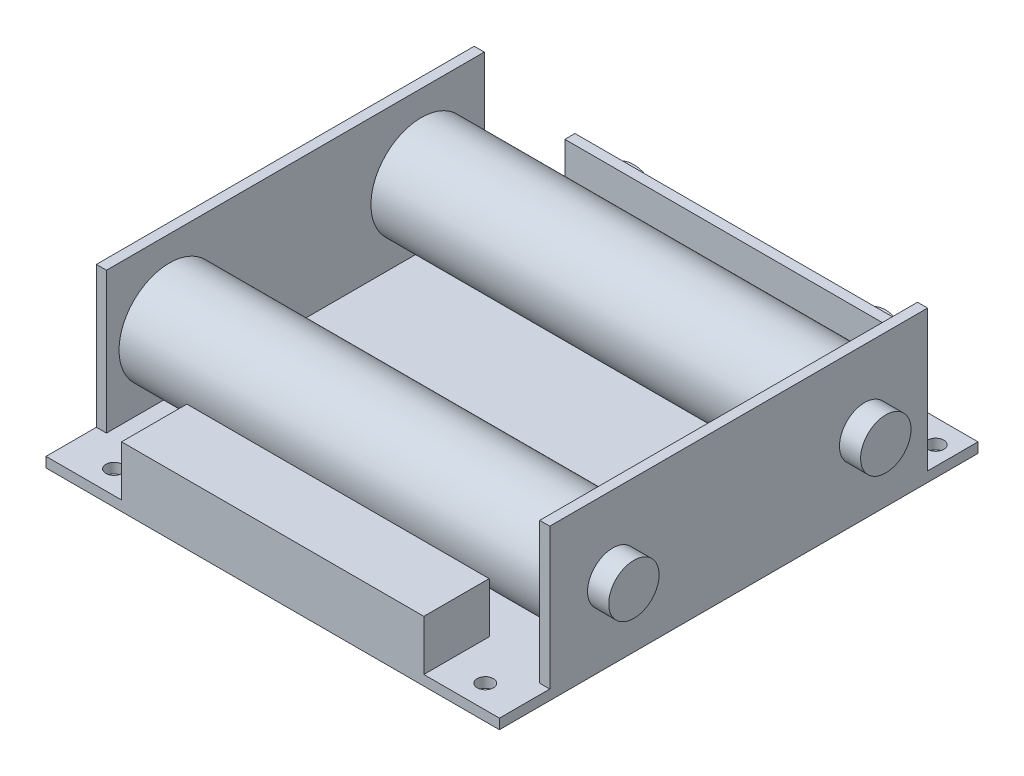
ISO-10303-21;
HEADER;
FILE_DESCRIPTION(('STEP AP214'),'2;1');
FILE_NAME('part.step','',(''),(''),'','','');
FILE_SCHEMA(('AUTOMOTIVE_DESIGN { 1 0 10303 214 1 1 1 1 }'));
ENDSEC;
DATA;
#1=APPLICATION_CONTEXT('core data for automotive mechanical design processes');
#2=APPLICATION_PROTOCOL_DEFINITION('international standard','automotive_design',2000,#1);
#3=PRODUCT_CONTEXT('',#1,'mechanical');
#4=PRODUCT('Part','Part','',(#3));
#5=PRODUCT_RELATED_PRODUCT_CATEGORY('part','',(#4));
#6=PRODUCT_DEFINITION_FORMATION('','',#4);
#7=PRODUCT_DEFINITION_CONTEXT('part definition',#1,'design');
#8=PRODUCT_DEFINITION('design','',#6,#7);
#9=PRODUCT_DEFINITION_SHAPE('','',#8);
#10=(LENGTH_UNIT() NAMED_UNIT(*) SI_UNIT(.MILLI.,.METRE.));
#11=(NAMED_UNIT(*) PLANE_ANGLE_UNIT() SI_UNIT($,.RADIAN.));
#12=(NAMED_UNIT(*) SI_UNIT($,.STERADIAN.) SOLID_ANGLE_UNIT());
#13=UNCERTAINTY_MEASURE_WITH_UNIT(LENGTH_MEASURE(1.E-05),#10,'distance_accuracy_value','');
#14=(GEOMETRIC_REPRESENTATION_CONTEXT(3) GLOBAL_UNCERTAINTY_ASSIGNED_CONTEXT((#13)) GLOBAL_UNIT_ASSIGNED_CONTEXT((#10,
#11,#12)) REPRESENTATION_CONTEXT('',''));
#15=CARTESIAN_POINT('',(0.,0.,0.));
#16=DIRECTION('',(0.,0.,1.));
#17=DIRECTION('',(1.,0.,0.));
#18=AXIS2_PLACEMENT_3D('',#15,#16,#17);
#19=CARTESIAN_POINT('',(-49.2,15.,25.));
#20=DIRECTION('',(1.,0.,0.));
#21=DIRECTION('',(0.,0.,-1.));
#22=AXIS2_PLACEMENT_3D('',#19,#20,#21);
#23=CYLINDRICAL_SURFACE('',#22,10.);
#24=CARTESIAN_POINT('',(43.,15.,25.));
#25=DIRECTION('',(1.,0.,0.));
#26=DIRECTION('',(0.,0.,-1.));
#27=AXIS2_PLACEMENT_3D('',#24,#25,#26);
#28=CIRCLE('',#27,10.);
#29=CARTESIAN_POINT('',(43.,15.,15.));
#30=VERTEX_POINT('',#29);
#31=EDGE_CURVE('E11',#30,#30,#28,.F.);
#32=ORIENTED_EDGE('',*,*,#31,.T.);
#33=EDGE_LOOP('',(#32));
#34=FACE_BOUND('',#33,.T.);
#35=CARTESIAN_POINT('',(-43.,15.,25.));
#36=DIRECTION('',(1.,0.,0.));
#37=DIRECTION('',(0.,0.,-1.));
#38=AXIS2_PLACEMENT_3D('',#35,#36,#37);
#39=CIRCLE('',#38,10.);
#40=CARTESIAN_POINT('',(-43.,15.,15.));
#41=VERTEX_POINT('',#40);
#42=EDGE_CURVE('E45',#41,#41,#39,.T.);
#43=ORIENTED_EDGE('',*,*,#42,.T.);
#44=EDGE_LOOP('',(#43));
#45=FACE_BOUND('',#44,.T.);
#46=ADVANCED_FACE('F44',(#34,#45),#23,.T.);
#47=OPEN_SHELL('',(#46));
#48=SHELL_BASED_SURFACE_MODEL('B2',(#47));
#49=CARTESIAN_POINT('',(-49.2,15.,-25.));
#50=DIRECTION('',(1.,0.,0.));
#51=DIRECTION('',(0.,0.,-1.));
#52=AXIS2_PLACEMENT_3D('',#49,#50,#51);
#53=CYLINDRICAL_SURFACE('',#52,10.);
#54=CARTESIAN_POINT('',(43.,15.,-25.));
#55=DIRECTION('',(1.,0.,0.));
#56=DIRECTION('',(0.,0.,-1.));
#57=AXIS2_PLACEMENT_3D('',#54,#55,#56);
#58=CIRCLE('',#57,10.);
#59=CARTESIAN_POINT('',(43.,15.,-35.));
#60=VERTEX_POINT('',#59);
#61=EDGE_CURVE('E84',#60,#60,#58,.F.);
#62=ORIENTED_EDGE('',*,*,#61,.T.);
#63=EDGE_LOOP('',(#62));
#64=FACE_BOUND('',#63,.T.);
#65=CARTESIAN_POINT('',(-43.,15.,-25.));
#66=DIRECTION('',(1.,0.,0.));
#67=DIRECTION('',(0.,0.,-1.));
#68=AXIS2_PLACEMENT_3D('',#65,#66,#67);
#69=CIRCLE('',#68,10.);
#70=CARTESIAN_POINT('',(-43.,15.,-35.));
#71=VERTEX_POINT('',#70);
#72=EDGE_CURVE('E43',#71,#71,#69,.T.);
#73=ORIENTED_EDGE('',*,*,#72,.T.);
#74=EDGE_LOOP('',(#73));
#75=FACE_BOUND('',#74,.T.);
#76=ADVANCED_FACE('F80',(#64,#75),#53,.T.);
#77=OPEN_SHELL('',(#76));
#78=SHELL_BASED_SURFACE_MODEL('B6',(#77));
#79=CARTESIAN_POINT('',(45.,2.,-47.5));
#80=DIRECTION('',(0.,0.,1.));
#81=DIRECTION('',(1.,0.,0.));
#82=AXIS2_PLACEMENT_3D('',#79,#80,#81);
#83=PLANE('',#82);
#84=CARTESIAN_POINT('',(22.45,6.3,-47.5));
#85=DIRECTION('',(0.,0.,1.));
#86=DIRECTION('',(1.,0.,0.));
#87=AXIS2_PLACEMENT_3D('',#84,#85,#86);
#88=CIRCLE('',#87,5.);
#89=CARTESIAN_POINT('',(27.45,6.3,-47.5));
#90=VERTEX_POINT('',#89);
#91=EDGE_CURVE('E115',#90,#90,#88,.F.);
#92=ORIENTED_EDGE('',*,*,#91,.F.);
#93=EDGE_LOOP('',(#92));
#94=FACE_BOUND('',#93,.T.);
#95=DIRECTION('',(-1.,0.,0.));
#96=VECTOR('',#95,1.);
#97=CARTESIAN_POINT('',(45.,2.,-47.5));
#98=LINE('',#97,#96);
#99=CARTESIAN_POINT('',(-35.,2.,-47.5));
#100=VERTEX_POINT('',#99);
#101=CARTESIAN_POINT('',(-45.,2.,-47.5));
#102=VERTEX_POINT('',#101);
#103=EDGE_CURVE('E431',#100,#102,#98,.T.);
#104=ORIENTED_EDGE('',*,*,#103,.F.);
#105=DIRECTION('',(0.,1.,0.));
#106=VECTOR('',#105,1.);
#107=CARTESIAN_POINT('',(-35.,0.,-47.5));
#108=LINE('',#107,#106);
#109=CARTESIAN_POINT('',(-35.,15.,-47.5));
#110=VERTEX_POINT('',#109);
#111=EDGE_CURVE('E271',#100,#110,#108,.T.);
#112=ORIENTED_EDGE('',*,*,#111,.T.);
#113=DIRECTION('',(1.,0.,0.));
#114=VECTOR('',#113,1.);
#115=CARTESIAN_POINT('',(35.,15.,-47.5));
#116=LINE('',#115,#114);
#117=CARTESIAN_POINT('',(35.,15.,-47.5));
#118=VERTEX_POINT('',#117);
#119=EDGE_CURVE('E259',#110,#118,#116,.T.);
#120=ORIENTED_EDGE('',*,*,#119,.T.);
#121=DIRECTION('',(0.,-1.,0.));
#122=VECTOR('',#121,1.);
#123=CARTESIAN_POINT('',(35.,0.,-47.5));
#124=LINE('',#123,#122);
#125=CARTESIAN_POINT('',(35.,2.,-47.5));
#126=VERTEX_POINT('',#125);
#127=EDGE_CURVE('E268',#118,#126,#124,.T.);
#128=ORIENTED_EDGE('',*,*,#127,.T.);
#129=CARTESIAN_POINT('',(45.,2.,-47.5));
#130=VERTEX_POINT('',#129);
#131=EDGE_CURVE('E432',#130,#126,#98,.T.);
#132=ORIENTED_EDGE('',*,*,#131,.F.);
#133=DIRECTION('',(0.,-1.,0.));
#134=VECTOR('',#133,1.);
#135=CARTESIAN_POINT('',(45.,2.,-47.5));
#136=LINE('',#135,#134);
#137=CARTESIAN_POINT('',(45.,0.,-47.5));
#138=VERTEX_POINT('',#137);
#139=EDGE_CURVE('E444',#130,#138,#136,.T.);
#140=ORIENTED_EDGE('',*,*,#139,.T.);
#141=DIRECTION('',(-1.,0.,0.));
#142=VECTOR('',#141,1.);
#143=CARTESIAN_POINT('',(45.,0.,-47.5));
#144=LINE('',#143,#142);
#145=CARTESIAN_POINT('',(-45.,0.,-47.5));
#146=VERTEX_POINT('',#145);
#147=EDGE_CURVE('E440',#138,#146,#144,.T.);
#148=ORIENTED_EDGE('',*,*,#147,.T.);
#149=DIRECTION('',(0.,-1.,0.));
#150=VECTOR('',#149,1.);
#151=CARTESIAN_POINT('',(-45.,2.,-47.5));
#152=LINE('',#151,#150);
#153=EDGE_CURVE('E434',#102,#146,#152,.T.);
#154=ORIENTED_EDGE('',*,*,#153,.F.);
#155=EDGE_LOOP('',(#104,#112,#120,#128,#132,#140,#148,#154));
#156=FACE_BOUND('',#155,.T.);
#157=CARTESIAN_POINT('',(-27.55,6.3,-47.5));
#158=DIRECTION('',(0.,0.,1.));
#159=DIRECTION('',(1.,0.,0.));
#160=AXIS2_PLACEMENT_3D('',#157,#158,#159);
#161=CIRCLE('',#160,5.);
#162=CARTESIAN_POINT('',(-22.55,6.3,-47.5));
#163=VERTEX_POINT('',#162);
#164=EDGE_CURVE('E78',#163,#163,#161,.F.);
#165=ORIENTED_EDGE('',*,*,#164,.F.);
#166=EDGE_LOOP('',(#165));
#167=FACE_BOUND('',#166,.T.);
#168=ADVANCED_FACE('F107',(#94,#156,#167),#83,.F.);
#169=CARTESIAN_POINT('',(0.,2.,0.));
#170=DIRECTION('',(0.,-1.,0.));
#171=DIRECTION('',(0.,0.,-1.));
#172=AXIS2_PLACEMENT_3D('',#169,#170,#171);
#173=PLANE('',#172);
#174=ORIENTED_EDGE('',*,*,#131,.T.);
#175=DIRECTION('',(0.,0.,1.));
#176=VECTOR('',#175,1.);
#177=CARTESIAN_POINT('',(35.,2.,0.));
#178=LINE('',#177,#176);
#179=CARTESIAN_POINT('',(35.,2.,-45.5));
#180=VERTEX_POINT('',#179);
#181=EDGE_CURVE('E127',#126,#180,#178,.T.);
#182=ORIENTED_EDGE('',*,*,#181,.T.);
#183=DIRECTION('',(-1.,0.,0.));
#184=VECTOR('',#183,1.);
#185=CARTESIAN_POINT('',(0.,2.,-45.5));
#186=LINE('',#185,#184);
#187=CARTESIAN_POINT('',(-35.,2.,-45.5));
#188=VERTEX_POINT('',#187);
#189=EDGE_CURVE('E122',#180,#188,#186,.T.);
#190=ORIENTED_EDGE('',*,*,#189,.T.);
#191=DIRECTION('',(0.,0.,-1.));
#192=VECTOR('',#191,1.);
#193=CARTESIAN_POINT('',(-35.,2.,0.));
#194=LINE('',#193,#192);
#195=EDGE_CURVE('E249',#188,#100,#194,.T.);
#196=ORIENTED_EDGE('',*,*,#195,.T.);
#197=ORIENTED_EDGE('',*,*,#103,.T.);
#198=DIRECTION('',(0.,0.,1.));
#199=VECTOR('',#198,1.);
#200=CARTESIAN_POINT('',(-45.,2.,-47.5));
#201=LINE('',#200,#199);
#202=CARTESIAN_POINT('',(-45.,2.,-37.5));
#203=VERTEX_POINT('',#202);
#204=EDGE_CURVE('E422',#102,#203,#201,.T.);
#205=ORIENTED_EDGE('',*,*,#204,.T.);
#206=DIRECTION('',(-1.,0.,0.));
#207=VECTOR('',#206,1.);
#208=CARTESIAN_POINT('',(0.,2.,-37.5));
#209=LINE('',#208,#207);
#210=CARTESIAN_POINT('',(-43.,2.,-37.5));
#211=VERTEX_POINT('',#210);
#212=EDGE_CURVE('E363',#211,#203,#209,.T.);
#213=ORIENTED_EDGE('',*,*,#212,.F.);
#214=DIRECTION('',(0.,0.,1.));
#215=VECTOR('',#214,1.);
#216=CARTESIAN_POINT('',(-43.,2.,0.));
#217=LINE('',#216,#215);
#218=CARTESIAN_POINT('',(-43.,2.,37.5));
#219=VERTEX_POINT('',#218);
#220=EDGE_CURVE('E359',#211,#219,#217,.T.);
#221=ORIENTED_EDGE('',*,*,#220,.T.);
#222=DIRECTION('',(1.,0.,0.));
#223=VECTOR('',#222,1.);
#224=CARTESIAN_POINT('',(0.,2.,37.5));
#225=LINE('',#224,#223);
#226=CARTESIAN_POINT('',(-45.,2.,37.5));
#227=VERTEX_POINT('',#226);
#228=EDGE_CURVE('E366',#227,#219,#225,.T.);
#229=ORIENTED_EDGE('',*,*,#228,.F.);
#230=CARTESIAN_POINT('',(-45.,2.,47.5));
#231=VERTEX_POINT('',#230);
#232=EDGE_CURVE('E425',#227,#231,#201,.T.);
#233=ORIENTED_EDGE('',*,*,#232,.T.);
#234=DIRECTION('',(1.,0.,0.));
#235=VECTOR('',#234,1.);
#236=CARTESIAN_POINT('',(45.,2.,47.5));
#237=LINE('',#236,#235);
#238=CARTESIAN_POINT('',(-30.,2.,47.5));
#239=VERTEX_POINT('',#238);
#240=EDGE_CURVE('E426',#231,#239,#237,.T.);
#241=ORIENTED_EDGE('',*,*,#240,.T.);
#242=DIRECTION('',(0.,0.,1.));
#243=VECTOR('',#242,1.);
#244=CARTESIAN_POINT('',(-30.,2.,34.5));
#245=LINE('',#244,#243);
#246=CARTESIAN_POINT('',(-30.,2.,34.5));
#247=VERTEX_POINT('',#246);
#248=EDGE_CURVE('E279',#247,#239,#245,.T.);
#249=ORIENTED_EDGE('',*,*,#248,.F.);
#250=DIRECTION('',(-1.,0.,0.));
#251=VECTOR('',#250,1.);
#252=CARTESIAN_POINT('',(-30.,2.,34.5));
#253=LINE('',#252,#251);
#254=CARTESIAN_POINT('',(30.,2.,34.5));
#255=VERTEX_POINT('',#254);
#256=EDGE_CURVE('E284',#255,#247,#253,.T.);
#257=ORIENTED_EDGE('',*,*,#256,.F.);
#258=DIRECTION('',(0.,0.,-1.));
#259=VECTOR('',#258,1.);
#260=CARTESIAN_POINT('',(30.,2.,34.5));
#261=LINE('',#260,#259);
#262=CARTESIAN_POINT('',(30.,2.,47.5));
#263=VERTEX_POINT('',#262);
#264=EDGE_CURVE('E293',#263,#255,#261,.T.);
#265=ORIENTED_EDGE('',*,*,#264,.F.);
#266=CARTESIAN_POINT('',(45.,2.,47.5));
#267=VERTEX_POINT('',#266);
#268=EDGE_CURVE('E424',#263,#267,#237,.T.);
#269=ORIENTED_EDGE('',*,*,#268,.T.);
#270=DIRECTION('',(0.,0.,-1.));
#271=VECTOR('',#270,1.);
#272=CARTESIAN_POINT('',(45.,2.,-47.5));
#273=LINE('',#272,#271);
#274=CARTESIAN_POINT('',(45.,2.,37.5));
#275=VERTEX_POINT('',#274);
#276=EDGE_CURVE('E429',#267,#275,#273,.T.);
#277=ORIENTED_EDGE('',*,*,#276,.T.);
#278=DIRECTION('',(-1.,0.,0.));
#279=VECTOR('',#278,1.);
#280=CARTESIAN_POINT('',(0.,2.,37.5));
#281=LINE('',#280,#279);
#282=CARTESIAN_POINT('',(43.,2.,37.5));
#283=VERTEX_POINT('',#282);
#284=EDGE_CURVE('E395',#275,#283,#281,.T.);
#285=ORIENTED_EDGE('',*,*,#284,.T.);
#286=DIRECTION('',(0.,0.,-1.));
#287=VECTOR('',#286,1.);
#288=CARTESIAN_POINT('',(43.,2.,0.));
#289=LINE('',#288,#287);
#290=CARTESIAN_POINT('',(43.,2.,-37.5));
#291=VERTEX_POINT('',#290);
#292=EDGE_CURVE('E388',#283,#291,#289,.T.);
#293=ORIENTED_EDGE('',*,*,#292,.T.);
#294=DIRECTION('',(1.,0.,0.));
#295=VECTOR('',#294,1.);
#296=CARTESIAN_POINT('',(0.,2.,-37.5));
#297=LINE('',#296,#295);
#298=CARTESIAN_POINT('',(45.,2.,-37.5));
#299=VERTEX_POINT('',#298);
#300=EDGE_CURVE('E392',#291,#299,#297,.T.);
#301=ORIENTED_EDGE('',*,*,#300,.T.);
#302=EDGE_CURVE('E428',#299,#130,#273,.T.);
#303=ORIENTED_EDGE('',*,*,#302,.T.);
#304=EDGE_LOOP('',(#174,#182,#190,#196,#197,#205,#213,#221,#229,#233,#241,#249,#257,#265,#269,
#277,#285,#293,#301,#303));
#305=FACE_BOUND('',#304,.T.);
#306=CARTESIAN_POINT('',(-36.1,2.,42.9));
#307=DIRECTION('',(0.,-1.,0.));
#308=DIRECTION('',(0.,0.,-1.));
#309=AXIS2_PLACEMENT_3D('',#306,#307,#308);
#310=CIRCLE('',#309,1.6);
#311=CARTESIAN_POINT('',(-36.1,2.,41.3));
#312=VERTEX_POINT('',#311);
#313=EDGE_CURVE('E400',#312,#312,#310,.T.);
#314=ORIENTED_EDGE('',*,*,#313,.T.);
#315=EDGE_LOOP('',(#314));
#316=FACE_BOUND('',#315,.T.);
#317=CARTESIAN_POINT('',(37.6,2.,42.9));
#318=DIRECTION('',(0.,-1.,0.));
#319=DIRECTION('',(0.,0.,-1.));
#320=AXIS2_PLACEMENT_3D('',#317,#318,#319);
#321=CIRCLE('',#320,1.6);
#322=CARTESIAN_POINT('',(37.6,2.,41.3));
#323=VERTEX_POINT('',#322);
#324=EDGE_CURVE('E406',#323,#323,#321,.T.);
#325=ORIENTED_EDGE('',*,*,#324,.T.);
#326=EDGE_LOOP('',(#325));
#327=FACE_BOUND('',#326,.T.);
#328=CARTESIAN_POINT('',(41.3,2.,-42.8));
#329=DIRECTION('',(0.,-1.,0.));
#330=DIRECTION('',(0.,0.,-1.));
#331=AXIS2_PLACEMENT_3D('',#328,#329,#330);
#332=CIRCLE('',#331,1.6);
#333=CARTESIAN_POINT('',(41.3,2.,-44.4));
#334=VERTEX_POINT('',#333);
#335=EDGE_CURVE('E412',#334,#334,#332,.T.);
#336=ORIENTED_EDGE('',*,*,#335,.T.);
#337=EDGE_LOOP('',(#336));
#338=FACE_BOUND('',#337,.T.);
#339=CARTESIAN_POINT('',(-38.7,2.,-42.8));
#340=DIRECTION('',(0.,-1.,0.));
#341=DIRECTION('',(0.,0.,-1.));
#342=AXIS2_PLACEMENT_3D('',#339,#340,#341);
#343=CIRCLE('',#342,1.6);
#344=CARTESIAN_POINT('',(-38.7,2.,-44.4));
#345=VERTEX_POINT('',#344);
#346=EDGE_CURVE('E418',#345,#345,#343,.T.);
#347=ORIENTED_EDGE('',*,*,#346,.T.);
#348=EDGE_LOOP('',(#347));
#349=FACE_BOUND('',#348,.T.);
#350=ADVANCED_FACE('F463',(#305,#316,#327,#338,#349),#173,.F.);
#351=CARTESIAN_POINT('',(-45.,2.,-47.5));
#352=DIRECTION('',(1.,0.,0.));
#353=DIRECTION('',(0.,0.,-1.));
#354=AXIS2_PLACEMENT_3D('',#351,#352,#353);
#355=PLANE('',#354);
#356=CARTESIAN_POINT('',(-45.,15.,-25.));
#357=DIRECTION('',(1.,0.,0.));
#358=DIRECTION('',(0.,0.,-1.));
#359=AXIS2_PLACEMENT_3D('',#356,#357,#358);
#360=CIRCLE('',#359,5.);
#361=CARTESIAN_POINT('',(-45.,15.,-30.));
#362=VERTEX_POINT('',#361);
#363=EDGE_CURVE('E322',#362,#362,#360,.T.);
#364=ORIENTED_EDGE('',*,*,#363,.T.);
#365=EDGE_LOOP('',(#364));
#366=FACE_BOUND('',#365,.T.);
#367=CARTESIAN_POINT('',(-45.,15.,25.));
#368=DIRECTION('',(1.,0.,0.));
#369=DIRECTION('',(0.,0.,-1.));
#370=AXIS2_PLACEMENT_3D('',#367,#368,#369);
#371=CIRCLE('',#370,5.);
#372=CARTESIAN_POINT('',(-45.,15.,20.));
#373=VERTEX_POINT('',#372);
#374=EDGE_CURVE('E338',#373,#373,#371,.T.);
#375=ORIENTED_EDGE('',*,*,#374,.T.);
#376=EDGE_LOOP('',(#375));
#377=FACE_BOUND('',#376,.T.);
#378=DIRECTION('',(0.,0.,1.));
#379=VECTOR('',#378,1.);
#380=CARTESIAN_POINT('',(-45.,0.,-47.5));
#381=LINE('',#380,#379);
#382=CARTESIAN_POINT('',(-45.,0.,47.5));
#383=VERTEX_POINT('',#382);
#384=EDGE_CURVE('E421',#146,#383,#381,.T.);
#385=ORIENTED_EDGE('',*,*,#384,.T.);
#386=DIRECTION('',(0.,-1.,0.));
#387=VECTOR('',#386,1.);
#388=CARTESIAN_POINT('',(-45.,2.,47.5));
#389=LINE('',#388,#387);
#390=EDGE_CURVE('E450',#231,#383,#389,.T.);
#391=ORIENTED_EDGE('',*,*,#390,.F.);
#392=ORIENTED_EDGE('',*,*,#232,.F.);
#393=DIRECTION('',(0.,-1.,0.));
#394=VECTOR('',#393,1.);
#395=CARTESIAN_POINT('',(-45.,0.,37.5));
#396=LINE('',#395,#394);
#397=CARTESIAN_POINT('',(-45.,30.,37.5));
#398=VERTEX_POINT('',#397);
#399=EDGE_CURVE('E341',#398,#227,#396,.T.);
#400=ORIENTED_EDGE('',*,*,#399,.F.);
#401=DIRECTION('',(0.,0.,1.));
#402=VECTOR('',#401,1.);
#403=CARTESIAN_POINT('',(-45.,30.,37.5));
#404=LINE('',#403,#402);
#405=CARTESIAN_POINT('',(-45.,30.,-37.5));
#406=VERTEX_POINT('',#405);
#407=EDGE_CURVE('E353',#406,#398,#404,.T.);
#408=ORIENTED_EDGE('',*,*,#407,.F.);
#409=DIRECTION('',(0.,1.,0.));
#410=VECTOR('',#409,1.);
#411=CARTESIAN_POINT('',(-45.,0.,-37.5));
#412=LINE('',#411,#410);
#413=EDGE_CURVE('E346',#203,#406,#412,.T.);
#414=ORIENTED_EDGE('',*,*,#413,.F.);
#415=ORIENTED_EDGE('',*,*,#204,.F.);
#416=ORIENTED_EDGE('',*,*,#153,.T.);
#417=EDGE_LOOP('',(#385,#391,#392,#400,#408,#414,#415,#416));
#418=FACE_BOUND('',#417,.T.);
#419=ADVANCED_FACE('F109',(#366,#377,#418),#355,.F.);
#420=CARTESIAN_POINT('',(45.,2.,47.5));
#421=DIRECTION('',(0.,0.,-1.));
#422=DIRECTION('',(-1.,0.,0.));
#423=AXIS2_PLACEMENT_3D('',#420,#421,#422);
#424=PLANE('',#423);
#425=DIRECTION('',(1.,0.,0.));
#426=VECTOR('',#425,1.);
#427=CARTESIAN_POINT('',(45.,0.,47.5));
#428=LINE('',#427,#426);
#429=CARTESIAN_POINT('',(45.,0.,47.5));
#430=VERTEX_POINT('',#429);
#431=EDGE_CURVE('E436',#383,#430,#428,.T.);
#432=ORIENTED_EDGE('',*,*,#431,.T.);
#433=DIRECTION('',(0.,-1.,0.));
#434=VECTOR('',#433,1.);
#435=CARTESIAN_POINT('',(45.,2.,47.5));
#436=LINE('',#435,#434);
#437=EDGE_CURVE('E447',#267,#430,#436,.T.);
#438=ORIENTED_EDGE('',*,*,#437,.F.);
#439=ORIENTED_EDGE('',*,*,#268,.F.);
#440=DIRECTION('',(0.,-1.,0.));
#441=VECTOR('',#440,1.);
#442=CARTESIAN_POINT('',(30.,12.,47.5));
#443=LINE('',#442,#441);
#444=CARTESIAN_POINT('',(30.,12.,47.5));
#445=VERTEX_POINT('',#444);
#446=EDGE_CURVE('E303',#445,#263,#443,.T.);
#447=ORIENTED_EDGE('',*,*,#446,.F.);
#448=DIRECTION('',(1.,0.,0.));
#449=VECTOR('',#448,1.);
#450=CARTESIAN_POINT('',(-30.,12.,47.5));
#451=LINE('',#450,#449);
#452=CARTESIAN_POINT('',(-30.,12.,47.5));
#453=VERTEX_POINT('',#452);
#454=EDGE_CURVE('E283',#453,#445,#451,.T.);
#455=ORIENTED_EDGE('',*,*,#454,.F.);
#456=DIRECTION('',(0.,-1.,0.));
#457=VECTOR('',#456,1.);
#458=CARTESIAN_POINT('',(-30.,12.,47.5));
#459=LINE('',#458,#457);
#460=EDGE_CURVE('E306',#453,#239,#459,.T.);
#461=ORIENTED_EDGE('',*,*,#460,.T.);
#462=ORIENTED_EDGE('',*,*,#240,.F.);
#463=ORIENTED_EDGE('',*,*,#390,.T.);
#464=EDGE_LOOP('',(#432,#438,#439,#447,#455,#461,#462,#463));
#465=FACE_BOUND('',#464,.T.);
#466=ADVANCED_FACE('F598',(#465),#424,.F.);
#467=CARTESIAN_POINT('',(45.,2.,-47.5));
#468=DIRECTION('',(-1.,0.,0.));
#469=DIRECTION('',(0.,0.,1.));
#470=AXIS2_PLACEMENT_3D('',#467,#468,#469);
#471=PLANE('',#470);
#472=CARTESIAN_POINT('',(45.,15.,-25.));
#473=DIRECTION('',(-1.,0.,0.));
#474=DIRECTION('',(0.,0.,1.));
#475=AXIS2_PLACEMENT_3D('',#472,#473,#474);
#476=CIRCLE('',#475,5.);
#477=CARTESIAN_POINT('',(45.,15.,-20.));
#478=VERTEX_POINT('',#477);
#479=EDGE_CURVE('E315',#478,#478,#476,.T.);
#480=ORIENTED_EDGE('',*,*,#479,.T.);
#481=EDGE_LOOP('',(#480));
#482=FACE_BOUND('',#481,.T.);
#483=CARTESIAN_POINT('',(45.,15.,25.));
#484=DIRECTION('',(-1.,0.,0.));
#485=DIRECTION('',(0.,0.,1.));
#486=AXIS2_PLACEMENT_3D('',#483,#484,#485);
#487=CIRCLE('',#486,5.);
#488=CARTESIAN_POINT('',(45.,15.,30.));
#489=VERTEX_POINT('',#488);
#490=EDGE_CURVE('E331',#489,#489,#487,.T.);
#491=ORIENTED_EDGE('',*,*,#490,.T.);
#492=EDGE_LOOP('',(#491));
#493=FACE_BOUND('',#492,.T.);
#494=ORIENTED_EDGE('',*,*,#302,.F.);
#495=DIRECTION('',(0.,1.,0.));
#496=VECTOR('',#495,1.);
#497=CARTESIAN_POINT('',(45.,0.,-37.5));
#498=LINE('',#497,#496);
#499=CARTESIAN_POINT('',(45.,30.,-37.5));
#500=VERTEX_POINT('',#499);
#501=EDGE_CURVE('E382',#299,#500,#498,.T.);
#502=ORIENTED_EDGE('',*,*,#501,.T.);
#503=DIRECTION('',(0.,0.,1.));
#504=VECTOR('',#503,1.);
#505=CARTESIAN_POINT('',(45.,30.,37.5));
#506=LINE('',#505,#504);
#507=CARTESIAN_POINT('',(45.,30.,37.5));
#508=VERTEX_POINT('',#507);
#509=EDGE_CURVE('E374',#500,#508,#506,.T.);
#510=ORIENTED_EDGE('',*,*,#509,.T.);
#511=DIRECTION('',(0.,-1.,0.));
#512=VECTOR('',#511,1.);
#513=CARTESIAN_POINT('',(45.,0.,37.5));
#514=LINE('',#513,#512);
#515=EDGE_CURVE('E369',#508,#275,#514,.T.);
#516=ORIENTED_EDGE('',*,*,#515,.T.);
#517=ORIENTED_EDGE('',*,*,#276,.F.);
#518=ORIENTED_EDGE('',*,*,#437,.T.);
#519=DIRECTION('',(0.,0.,-1.));
#520=VECTOR('',#519,1.);
#521=CARTESIAN_POINT('',(45.,0.,-47.5));
#522=LINE('',#521,#520);
#523=EDGE_CURVE('E438',#430,#138,#522,.T.);
#524=ORIENTED_EDGE('',*,*,#523,.T.);
#525=ORIENTED_EDGE('',*,*,#139,.F.);
#526=EDGE_LOOP('',(#494,#502,#510,#516,#517,#518,#524,#525));
#527=FACE_BOUND('',#526,.T.);
#528=ADVANCED_FACE('F594',(#482,#493,#527),#471,.F.);
#529=CARTESIAN_POINT('',(0.,0.,0.));
#530=DIRECTION('',(0.,-1.,0.));
#531=DIRECTION('',(0.,0.,-1.));
#532=AXIS2_PLACEMENT_3D('',#529,#530,#531);
#533=PLANE('',#532);
#534=ORIENTED_EDGE('',*,*,#384,.F.);
#535=ORIENTED_EDGE('',*,*,#147,.F.);
#536=ORIENTED_EDGE('',*,*,#523,.F.);
#537=ORIENTED_EDGE('',*,*,#431,.F.);
#538=EDGE_LOOP('',(#534,#535,#536,#537));
#539=FACE_BOUND('',#538,.T.);
#540=CARTESIAN_POINT('',(-38.7,0.,-42.8));
#541=DIRECTION('',(0.,-1.,0.));
#542=DIRECTION('',(0.,0.,-1.));
#543=AXIS2_PLACEMENT_3D('',#540,#541,#542);
#544=CIRCLE('',#543,1.59999999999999);
#545=CARTESIAN_POINT('',(-38.7,0.,-44.4));
#546=VERTEX_POINT('',#545);
#547=EDGE_CURVE('E415',#546,#546,#544,.T.);
#548=ORIENTED_EDGE('',*,*,#547,.F.);
#549=EDGE_LOOP('',(#548));
#550=FACE_BOUND('',#549,.T.);
#551=CARTESIAN_POINT('',(41.3,0.,-42.8));
#552=DIRECTION('',(0.,-1.,0.));
#553=DIRECTION('',(0.,0.,-1.));
#554=AXIS2_PLACEMENT_3D('',#551,#552,#553);
#555=CIRCLE('',#554,1.59999999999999);
#556=CARTESIAN_POINT('',(41.3,0.,-44.4));
#557=VERTEX_POINT('',#556);
#558=EDGE_CURVE('E409',#557,#557,#555,.T.);
#559=ORIENTED_EDGE('',*,*,#558,.F.);
#560=EDGE_LOOP('',(#559));
#561=FACE_BOUND('',#560,.T.);
#562=CARTESIAN_POINT('',(37.6,0.,42.9));
#563=DIRECTION('',(0.,-1.,0.));
#564=DIRECTION('',(0.,0.,-1.));
#565=AXIS2_PLACEMENT_3D('',#562,#563,#564);
#566=CIRCLE('',#565,1.59999999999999);
#567=CARTESIAN_POINT('',(37.6,0.,41.3));
#568=VERTEX_POINT('',#567);
#569=EDGE_CURVE('E403',#568,#568,#566,.T.);
#570=ORIENTED_EDGE('',*,*,#569,.F.);
#571=EDGE_LOOP('',(#570));
#572=FACE_BOUND('',#571,.T.);
#573=CARTESIAN_POINT('',(-36.1,0.,42.9));
#574=DIRECTION('',(0.,-1.,0.));
#575=DIRECTION('',(0.,0.,-1.));
#576=AXIS2_PLACEMENT_3D('',#573,#574,#575);
#577=CIRCLE('',#576,1.59999999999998);
#578=CARTESIAN_POINT('',(-36.1,0.,41.3));
#579=VERTEX_POINT('',#578);
#580=EDGE_CURVE('E397',#579,#579,#577,.T.);
#581=ORIENTED_EDGE('',*,*,#580,.F.);
#582=EDGE_LOOP('',(#581));
#583=FACE_BOUND('',#582,.T.);
#584=ADVANCED_FACE('F589',(#539,#550,#561,#572,#583),#533,.T.);
#585=CARTESIAN_POINT('',(-38.7,0.,-42.8));
#586=DIRECTION('',(0.,-1.,0.));
#587=DIRECTION('',(0.,0.,-1.));
#588=AXIS2_PLACEMENT_3D('',#585,#586,#587);
#589=CYLINDRICAL_SURFACE('',#588,1.59999999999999);
#590=ORIENTED_EDGE('',*,*,#346,.F.);
#591=EDGE_LOOP('',(#590));
#592=FACE_BOUND('',#591,.T.);
#593=ORIENTED_EDGE('',*,*,#547,.T.);
#594=EDGE_LOOP('',(#593));
#595=FACE_BOUND('',#594,.T.);
#596=ADVANCED_FACE('F585',(#592,#595),#589,.F.);
#597=CARTESIAN_POINT('',(41.3,0.,-42.8));
#598=DIRECTION('',(0.,-1.,0.));
#599=DIRECTION('',(0.,0.,-1.));
#600=AXIS2_PLACEMENT_3D('',#597,#598,#599);
#601=CYLINDRICAL_SURFACE('',#600,1.59999999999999);
#602=ORIENTED_EDGE('',*,*,#335,.F.);
#603=EDGE_LOOP('',(#602));
#604=FACE_BOUND('',#603,.T.);
#605=ORIENTED_EDGE('',*,*,#558,.T.);
#606=EDGE_LOOP('',(#605));
#607=FACE_BOUND('',#606,.T.);
#608=ADVANCED_FACE('F581',(#604,#607),#601,.F.);
#609=CARTESIAN_POINT('',(37.6,0.,42.9));
#610=DIRECTION('',(0.,-1.,0.));
#611=DIRECTION('',(0.,0.,-1.));
#612=AXIS2_PLACEMENT_3D('',#609,#610,#611);
#613=CYLINDRICAL_SURFACE('',#612,1.59999999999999);
#614=ORIENTED_EDGE('',*,*,#324,.F.);
#615=EDGE_LOOP('',(#614));
#616=FACE_BOUND('',#615,.T.);
#617=ORIENTED_EDGE('',*,*,#569,.T.);
#618=EDGE_LOOP('',(#617));
#619=FACE_BOUND('',#618,.T.);
#620=ADVANCED_FACE('F577',(#616,#619),#613,.F.);
#621=CARTESIAN_POINT('',(-36.1,0.,42.9));
#622=DIRECTION('',(0.,-1.,0.));
#623=DIRECTION('',(0.,0.,-1.));
#624=AXIS2_PLACEMENT_3D('',#621,#622,#623);
#625=CYLINDRICAL_SURFACE('',#624,1.59999999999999);
#626=ORIENTED_EDGE('',*,*,#313,.F.);
#627=EDGE_LOOP('',(#626));
#628=FACE_BOUND('',#627,.T.);
#629=ORIENTED_EDGE('',*,*,#580,.T.);
#630=EDGE_LOOP('',(#629));
#631=FACE_BOUND('',#630,.T.);
#632=ADVANCED_FACE('F573',(#628,#631),#625,.F.);
#633=CARTESIAN_POINT('',(43.,0.,37.5));
#634=DIRECTION('',(0.,0.,1.));
#635=DIRECTION('',(1.,0.,0.));
#636=AXIS2_PLACEMENT_3D('',#633,#634,#635);
#637=PLANE('',#636);
#638=ORIENTED_EDGE('',*,*,#284,.F.);
#639=ORIENTED_EDGE('',*,*,#515,.F.);
#640=DIRECTION('',(1.,0.,0.));
#641=VECTOR('',#640,1.);
#642=CARTESIAN_POINT('',(43.,30.,37.5));
#643=LINE('',#642,#641);
#644=CARTESIAN_POINT('',(43.,30.,37.5));
#645=VERTEX_POINT('',#644);
#646=EDGE_CURVE('E386',#645,#508,#643,.T.);
#647=ORIENTED_EDGE('',*,*,#646,.F.);
#648=DIRECTION('',(0.,-1.,0.));
#649=VECTOR('',#648,1.);
#650=CARTESIAN_POINT('',(43.,0.,37.5));
#651=LINE('',#650,#649);
#652=EDGE_CURVE('E370',#645,#283,#651,.T.);
#653=ORIENTED_EDGE('',*,*,#652,.T.);
#654=EDGE_LOOP('',(#638,#639,#647,#653));
#655=FACE_BOUND('',#654,.T.);
#656=ADVANCED_FACE('F569',(#655),#637,.T.);
#657=CARTESIAN_POINT('',(43.,0.,-37.5));
#658=DIRECTION('',(0.,0.,-1.));
#659=DIRECTION('',(-1.,0.,0.));
#660=AXIS2_PLACEMENT_3D('',#657,#658,#659);
#661=PLANE('',#660);
#662=ORIENTED_EDGE('',*,*,#300,.F.);
#663=DIRECTION('',(0.,1.,0.));
#664=VECTOR('',#663,1.);
#665=CARTESIAN_POINT('',(43.,0.,-37.5));
#666=LINE('',#665,#664);
#667=CARTESIAN_POINT('',(43.,30.,-37.5));
#668=VERTEX_POINT('',#667);
#669=EDGE_CURVE('E373',#291,#668,#666,.T.);
#670=ORIENTED_EDGE('',*,*,#669,.T.);
#671=DIRECTION('',(1.,0.,0.));
#672=VECTOR('',#671,1.);
#673=CARTESIAN_POINT('',(43.,30.,-37.5));
#674=LINE('',#673,#672);
#675=EDGE_CURVE('E379',#668,#500,#674,.T.);
#676=ORIENTED_EDGE('',*,*,#675,.T.);
#677=ORIENTED_EDGE('',*,*,#501,.F.);
#678=EDGE_LOOP('',(#662,#670,#676,#677));
#679=FACE_BOUND('',#678,.T.);
#680=ADVANCED_FACE('F562',(#679),#661,.T.);
#681=CARTESIAN_POINT('',(43.,0.,0.));
#682=DIRECTION('',(-1.,0.,0.));
#683=DIRECTION('',(0.,0.,1.));
#684=AXIS2_PLACEMENT_3D('',#681,#682,#683);
#685=PLANE('',#684);
#686=CARTESIAN_POINT('',(43.,15.,-25.));
#687=DIRECTION('',(-1.,0.,0.));
#688=DIRECTION('',(0.,0.,1.));
#689=AXIS2_PLACEMENT_3D('',#686,#687,#688);
#690=CIRCLE('',#689,5.);
#691=CARTESIAN_POINT('',(43.,15.,-20.));
#692=VERTEX_POINT('',#691);
#693=EDGE_CURVE('E316',#692,#692,#690,.T.);
#694=ORIENTED_EDGE('',*,*,#693,.F.);
#695=EDGE_LOOP('',(#694));
#696=FACE_BOUND('',#695,.T.);
#697=CARTESIAN_POINT('',(43.,15.,25.));
#698=DIRECTION('',(-1.,0.,0.));
#699=DIRECTION('',(0.,0.,1.));
#700=AXIS2_PLACEMENT_3D('',#697,#698,#699);
#701=CIRCLE('',#700,5.);
#702=CARTESIAN_POINT('',(43.,15.,30.));
#703=VERTEX_POINT('',#702);
#704=EDGE_CURVE('E332',#703,#703,#701,.T.);
#705=ORIENTED_EDGE('',*,*,#704,.F.);
#706=EDGE_LOOP('',(#705));
#707=FACE_BOUND('',#706,.T.);
#708=ORIENTED_EDGE('',*,*,#292,.F.);
#709=ORIENTED_EDGE('',*,*,#652,.F.);
#710=DIRECTION('',(0.,0.,1.));
#711=VECTOR('',#710,1.);
#712=CARTESIAN_POINT('',(43.,30.,37.5));
#713=LINE('',#712,#711);
#714=EDGE_CURVE('E376',#668,#645,#713,.T.);
#715=ORIENTED_EDGE('',*,*,#714,.F.);
#716=ORIENTED_EDGE('',*,*,#669,.F.);
#717=EDGE_LOOP('',(#708,#709,#715,#716));
#718=FACE_BOUND('',#717,.T.);
#719=ADVANCED_FACE('F559',(#696,#707,#718),#685,.T.);
#720=CARTESIAN_POINT('',(43.,30.,37.5));
#721=DIRECTION('',(0.,1.,0.));
#722=DIRECTION('',(0.,0.,1.));
#723=AXIS2_PLACEMENT_3D('',#720,#721,#722);
#724=PLANE('',#723);
#725=ORIENTED_EDGE('',*,*,#509,.F.);
#726=ORIENTED_EDGE('',*,*,#675,.F.);
#727=ORIENTED_EDGE('',*,*,#714,.T.);
#728=ORIENTED_EDGE('',*,*,#646,.T.);
#729=EDGE_LOOP('',(#725,#726,#727,#728));
#730=FACE_BOUND('',#729,.T.);
#731=ADVANCED_FACE('F557',(#730),#724,.T.);
#732=CARTESIAN_POINT('',(-43.,0.,37.5));
#733=DIRECTION('',(0.,0.,-1.));
#734=DIRECTION('',(-1.,0.,0.));
#735=AXIS2_PLACEMENT_3D('',#732,#733,#734);
#736=PLANE('',#735);
#737=ORIENTED_EDGE('',*,*,#399,.T.);
#738=ORIENTED_EDGE('',*,*,#228,.T.);
#739=DIRECTION('',(0.,-1.,0.));
#740=VECTOR('',#739,1.);
#741=CARTESIAN_POINT('',(-43.,0.,37.5));
#742=LINE('',#741,#740);
#743=CARTESIAN_POINT('',(-43.,30.,37.5));
#744=VERTEX_POINT('',#743);
#745=EDGE_CURVE('E342',#744,#219,#742,.T.);
#746=ORIENTED_EDGE('',*,*,#745,.F.);
#747=DIRECTION('',(-1.,0.,0.));
#748=VECTOR('',#747,1.);
#749=CARTESIAN_POINT('',(-43.,30.,37.5));
#750=LINE('',#749,#748);
#751=EDGE_CURVE('E350',#744,#398,#750,.T.);
#752=ORIENTED_EDGE('',*,*,#751,.T.);
#753=EDGE_LOOP('',(#737,#738,#746,#752));
#754=FACE_BOUND('',#753,.T.);
#755=ADVANCED_FACE('F550',(#754),#736,.F.);
#756=CARTESIAN_POINT('',(-43.,0.,-37.5));
#757=DIRECTION('',(0.,0.,1.));
#758=DIRECTION('',(1.,0.,0.));
#759=AXIS2_PLACEMENT_3D('',#756,#757,#758);
#760=PLANE('',#759);
#761=DIRECTION('',(0.,1.,0.));
#762=VECTOR('',#761,1.);
#763=CARTESIAN_POINT('',(-43.,0.,-37.5));
#764=LINE('',#763,#762);
#765=CARTESIAN_POINT('',(-43.,30.,-37.5));
#766=VERTEX_POINT('',#765);
#767=EDGE_CURVE('E348',#211,#766,#764,.T.);
#768=ORIENTED_EDGE('',*,*,#767,.F.);
#769=ORIENTED_EDGE('',*,*,#212,.T.);
#770=ORIENTED_EDGE('',*,*,#413,.T.);
#771=DIRECTION('',(-1.,0.,0.));
#772=VECTOR('',#771,1.);
#773=CARTESIAN_POINT('',(-43.,30.,-37.5));
#774=LINE('',#773,#772);
#775=EDGE_CURVE('E356',#766,#406,#774,.T.);
#776=ORIENTED_EDGE('',*,*,#775,.F.);
#777=EDGE_LOOP('',(#768,#769,#770,#776));
#778=FACE_BOUND('',#777,.T.);
#779=ADVANCED_FACE('F546',(#778),#760,.F.);
#780=CARTESIAN_POINT('',(-43.,0.,0.));
#781=DIRECTION('',(1.,0.,0.));
#782=DIRECTION('',(0.,0.,1.));
#783=AXIS2_PLACEMENT_3D('',#780,#781,#782);
#784=PLANE('',#783);
#785=CARTESIAN_POINT('',(-43.,15.,-25.));
#786=DIRECTION('',(1.,0.,0.));
#787=DIRECTION('',(0.,0.,-1.));
#788=AXIS2_PLACEMENT_3D('',#785,#786,#787);
#789=CIRCLE('',#788,5.);
#790=CARTESIAN_POINT('',(-43.,15.,-30.));
#791=VERTEX_POINT('',#790);
#792=EDGE_CURVE('E319',#791,#791,#789,.T.);
#793=ORIENTED_EDGE('',*,*,#792,.F.);
#794=EDGE_LOOP('',(#793));
#795=FACE_BOUND('',#794,.T.);
#796=CARTESIAN_POINT('',(-43.,15.,25.));
#797=DIRECTION('',(1.,0.,0.));
#798=DIRECTION('',(0.,0.,-1.));
#799=AXIS2_PLACEMENT_3D('',#796,#797,#798);
#800=CIRCLE('',#799,5.);
#801=CARTESIAN_POINT('',(-43.,15.,20.));
#802=VERTEX_POINT('',#801);
#803=EDGE_CURVE('E335',#802,#802,#800,.T.);
#804=ORIENTED_EDGE('',*,*,#803,.F.);
#805=EDGE_LOOP('',(#804));
#806=FACE_BOUND('',#805,.T.);
#807=ORIENTED_EDGE('',*,*,#220,.F.);
#808=ORIENTED_EDGE('',*,*,#767,.T.);
#809=DIRECTION('',(0.,0.,1.));
#810=VECTOR('',#809,1.);
#811=CARTESIAN_POINT('',(-43.,30.,37.5));
#812=LINE('',#811,#810);
#813=EDGE_CURVE('E345',#766,#744,#812,.T.);
#814=ORIENTED_EDGE('',*,*,#813,.T.);
#815=ORIENTED_EDGE('',*,*,#745,.T.);
#816=EDGE_LOOP('',(#807,#808,#814,#815));
#817=FACE_BOUND('',#816,.T.);
#818=ADVANCED_FACE('F543',(#795,#806,#817),#784,.T.);
#819=CARTESIAN_POINT('',(-43.,30.,37.5));
#820=DIRECTION('',(0.,-1.,0.));
#821=DIRECTION('',(0.,0.,-1.));
#822=AXIS2_PLACEMENT_3D('',#819,#820,#821);
#823=PLANE('',#822);
#824=ORIENTED_EDGE('',*,*,#407,.T.);
#825=ORIENTED_EDGE('',*,*,#751,.F.);
#826=ORIENTED_EDGE('',*,*,#813,.F.);
#827=ORIENTED_EDGE('',*,*,#775,.T.);
#828=EDGE_LOOP('',(#824,#825,#826,#827));
#829=FACE_BOUND('',#828,.T.);
#830=ADVANCED_FACE('F541',(#829),#823,.F.);
#831=CARTESIAN_POINT('',(-49.2,15.,25.));
#832=DIRECTION('',(1.,0.,0.));
#833=DIRECTION('',(0.,0.,-1.));
#834=AXIS2_PLACEMENT_3D('',#831,#832,#833);
#835=CYLINDRICAL_SURFACE('',#834,5.);
#836=ORIENTED_EDGE('',*,*,#704,.T.);
#837=EDGE_LOOP('',(#836));
#838=FACE_BOUND('',#837,.T.);
#839=ORIENTED_EDGE('',*,*,#803,.T.);
#840=EDGE_LOOP('',(#839));
#841=FACE_BOUND('',#840,.T.);
#842=ADVANCED_FACE('F533',(#838,#841),#835,.T.);
#843=CARTESIAN_POINT('',(49.2,15.,25.));
#844=DIRECTION('',(1.,0.,0.));
#845=DIRECTION('',(0.,0.,-1.));
#846=AXIS2_PLACEMENT_3D('',#843,#844,#845);
#847=PLANE('',#846);
#848=CARTESIAN_POINT('',(49.2,15.,25.));
#849=DIRECTION('',(1.,0.,0.));
#850=DIRECTION('',(0.,0.,-1.));
#851=AXIS2_PLACEMENT_3D('',#848,#849,#850);
#852=CIRCLE('',#851,5.);
#853=CARTESIAN_POINT('',(49.2,15.,20.));
#854=VERTEX_POINT('',#853);
#855=EDGE_CURVE('E325',#854,#854,#852,.T.);
#856=ORIENTED_EDGE('',*,*,#855,.T.);
#857=EDGE_LOOP('',(#856));
#858=FACE_BOUND('',#857,.T.);
#859=ADVANCED_FACE('F529',(#858),#847,.T.);
#860=ORIENTED_EDGE('',*,*,#855,.F.);
#861=EDGE_LOOP('',(#860));
#862=FACE_BOUND('',#861,.T.);
#863=ORIENTED_EDGE('',*,*,#490,.F.);
#864=EDGE_LOOP('',(#863));
#865=FACE_BOUND('',#864,.T.);
#866=ADVANCED_FACE('F532',(#862,#865),#835,.T.);
#867=CARTESIAN_POINT('',(-49.2,15.,25.));
#868=DIRECTION('',(1.,0.,0.));
#869=DIRECTION('',(0.,0.,-1.));
#870=AXIS2_PLACEMENT_3D('',#867,#868,#869);
#871=CIRCLE('',#870,5.);
#872=CARTESIAN_POINT('',(-49.2,15.,20.));
#873=VERTEX_POINT('',#872);
#874=EDGE_CURVE('E328',#873,#873,#871,.T.);
#875=ORIENTED_EDGE('',*,*,#874,.T.);
#876=EDGE_LOOP('',(#875));
#877=FACE_BOUND('',#876,.T.);
#878=ORIENTED_EDGE('',*,*,#374,.F.);
#879=EDGE_LOOP('',(#878));
#880=FACE_BOUND('',#879,.T.);
#881=ADVANCED_FACE('F537',(#877,#880),#835,.T.);
#882=CARTESIAN_POINT('',(-49.2,15.,25.));
#883=DIRECTION('',(1.,0.,0.));
#884=DIRECTION('',(0.,0.,-1.));
#885=AXIS2_PLACEMENT_3D('',#882,#883,#884);
#886=PLANE('',#885);
#887=ORIENTED_EDGE('',*,*,#874,.F.);
#888=EDGE_LOOP('',(#887));
#889=FACE_BOUND('',#888,.T.);
#890=ADVANCED_FACE('F527',(#889),#886,.F.);
#891=CARTESIAN_POINT('',(-49.2,15.,-25.));
#892=DIRECTION('',(1.,0.,0.));
#893=DIRECTION('',(0.,0.,-1.));
#894=AXIS2_PLACEMENT_3D('',#891,#892,#893);
#895=CYLINDRICAL_SURFACE('',#894,5.);
#896=ORIENTED_EDGE('',*,*,#693,.T.);
#897=EDGE_LOOP('',(#896));
#898=FACE_BOUND('',#897,.T.);
#899=ORIENTED_EDGE('',*,*,#792,.T.);
#900=EDGE_LOOP('',(#899));
#901=FACE_BOUND('',#900,.T.);
#902=ADVANCED_FACE('F519',(#898,#901),#895,.T.);
#903=CARTESIAN_POINT('',(49.2,15.,-25.));
#904=DIRECTION('',(1.,0.,0.));
#905=DIRECTION('',(0.,0.,-1.));
#906=AXIS2_PLACEMENT_3D('',#903,#904,#905);
#907=PLANE('',#906);
#908=CARTESIAN_POINT('',(49.2,15.,-25.));
#909=DIRECTION('',(1.,0.,0.));
#910=DIRECTION('',(0.,0.,-1.));
#911=AXIS2_PLACEMENT_3D('',#908,#909,#910);
#912=CIRCLE('',#911,5.);
#913=CARTESIAN_POINT('',(49.2,15.,-30.));
#914=VERTEX_POINT('',#913);
#915=EDGE_CURVE('E309',#914,#914,#912,.T.);
#916=ORIENTED_EDGE('',*,*,#915,.T.);
#917=EDGE_LOOP('',(#916));
#918=FACE_BOUND('',#917,.T.);
#919=ADVANCED_FACE('F515',(#918),#907,.T.);
#920=ORIENTED_EDGE('',*,*,#915,.F.);
#921=EDGE_LOOP('',(#920));
#922=FACE_BOUND('',#921,.T.);
#923=ORIENTED_EDGE('',*,*,#479,.F.);
#924=EDGE_LOOP('',(#923));
#925=FACE_BOUND('',#924,.T.);
#926=ADVANCED_FACE('F518',(#922,#925),#895,.T.);
#927=CARTESIAN_POINT('',(-49.2,15.,-25.));
#928=DIRECTION('',(1.,0.,0.));
#929=DIRECTION('',(0.,0.,-1.));
#930=AXIS2_PLACEMENT_3D('',#927,#928,#929);
#931=CIRCLE('',#930,5.);
#932=CARTESIAN_POINT('',(-49.2,15.,-30.));
#933=VERTEX_POINT('',#932);
#934=EDGE_CURVE('E312',#933,#933,#931,.T.);
#935=ORIENTED_EDGE('',*,*,#934,.T.);
#936=EDGE_LOOP('',(#935));
#937=FACE_BOUND('',#936,.T.);
#938=ORIENTED_EDGE('',*,*,#363,.F.);
#939=EDGE_LOOP('',(#938));
#940=FACE_BOUND('',#939,.T.);
#941=ADVANCED_FACE('F523',(#937,#940),#895,.T.);
#942=CARTESIAN_POINT('',(-49.2,15.,-25.));
#943=DIRECTION('',(1.,0.,0.));
#944=DIRECTION('',(0.,0.,-1.));
#945=AXIS2_PLACEMENT_3D('',#942,#943,#944);
#946=PLANE('',#945);
#947=ORIENTED_EDGE('',*,*,#934,.F.);
#948=EDGE_LOOP('',(#947));
#949=FACE_BOUND('',#948,.T.);
#950=ADVANCED_FACE('F513',(#949),#946,.F.);
#951=CARTESIAN_POINT('',(-30.,12.,34.5));
#952=DIRECTION('',(1.,0.,0.));
#953=DIRECTION('',(0.,0.,-1.));
#954=AXIS2_PLACEMENT_3D('',#951,#952,#953);
#955=PLANE('',#954);
#956=ORIENTED_EDGE('',*,*,#248,.T.);
#957=ORIENTED_EDGE('',*,*,#460,.F.);
#958=DIRECTION('',(0.,0.,1.));
#959=VECTOR('',#958,1.);
#960=CARTESIAN_POINT('',(-30.,12.,34.5));
#961=LINE('',#960,#959);
#962=CARTESIAN_POINT('',(-30.,12.,34.5));
#963=VERTEX_POINT('',#962);
#964=EDGE_CURVE('E280',#963,#453,#961,.T.);
#965=ORIENTED_EDGE('',*,*,#964,.F.);
#966=DIRECTION('',(0.,-1.,0.));
#967=VECTOR('',#966,1.);
#968=CARTESIAN_POINT('',(-30.,12.,34.5));
#969=LINE('',#968,#967);
#970=EDGE_CURVE('E290',#963,#247,#969,.T.);
#971=ORIENTED_EDGE('',*,*,#970,.T.);
#972=EDGE_LOOP('',(#956,#957,#965,#971));
#973=FACE_BOUND('',#972,.T.);
#974=ADVANCED_FACE('F509',(#973),#955,.F.);
#975=CARTESIAN_POINT('',(30.,12.,34.5));
#976=DIRECTION('',(-1.,0.,0.));
#977=DIRECTION('',(0.,0.,1.));
#978=AXIS2_PLACEMENT_3D('',#975,#976,#977);
#979=PLANE('',#978);
#980=ORIENTED_EDGE('',*,*,#264,.T.);
#981=DIRECTION('',(0.,-1.,0.));
#982=VECTOR('',#981,1.);
#983=CARTESIAN_POINT('',(30.,12.,34.5));
#984=LINE('',#983,#982);
#985=CARTESIAN_POINT('',(30.,12.,34.5));
#986=VERTEX_POINT('',#985);
#987=EDGE_CURVE('E300',#986,#255,#984,.T.);
#988=ORIENTED_EDGE('',*,*,#987,.F.);
#989=DIRECTION('',(0.,0.,-1.));
#990=VECTOR('',#989,1.);
#991=CARTESIAN_POINT('',(30.,12.,34.5));
#992=LINE('',#991,#990);
#993=EDGE_CURVE('E286',#445,#986,#992,.T.);
#994=ORIENTED_EDGE('',*,*,#993,.F.);
#995=ORIENTED_EDGE('',*,*,#446,.T.);
#996=EDGE_LOOP('',(#980,#988,#994,#995));
#997=FACE_BOUND('',#996,.T.);
#998=ADVANCED_FACE('F505',(#997),#979,.F.);
#999=CARTESIAN_POINT('',(-30.,12.,34.5));
#1000=DIRECTION('',(0.,0.,1.));
#1001=DIRECTION('',(1.,0.,0.));
#1002=AXIS2_PLACEMENT_3D('',#999,#1000,#1001);
#1003=PLANE('',#1002);
#1004=ORIENTED_EDGE('',*,*,#256,.T.);
#1005=ORIENTED_EDGE('',*,*,#970,.F.);
#1006=DIRECTION('',(-1.,0.,0.));
#1007=VECTOR('',#1006,1.);
#1008=CARTESIAN_POINT('',(-30.,12.,34.5));
#1009=LINE('',#1008,#1007);
#1010=EDGE_CURVE('E288',#986,#963,#1009,.T.);
#1011=ORIENTED_EDGE('',*,*,#1010,.F.);
#1012=ORIENTED_EDGE('',*,*,#987,.T.);
#1013=EDGE_LOOP('',(#1004,#1005,#1011,#1012));
#1014=FACE_BOUND('',#1013,.T.);
#1015=ADVANCED_FACE('F501',(#1014),#1003,.F.);
#1016=CARTESIAN_POINT('',(0.,12.,0.));
#1017=DIRECTION('',(0.,1.,0.));
#1018=DIRECTION('',(0.,0.,1.));
#1019=AXIS2_PLACEMENT_3D('',#1016,#1017,#1018);
#1020=PLANE('',#1019);
#1021=ORIENTED_EDGE('',*,*,#964,.T.);
#1022=ORIENTED_EDGE('',*,*,#454,.T.);
#1023=ORIENTED_EDGE('',*,*,#993,.T.);
#1024=ORIENTED_EDGE('',*,*,#1010,.T.);
#1025=EDGE_LOOP('',(#1021,#1022,#1023,#1024));
#1026=FACE_BOUND('',#1025,.T.);
#1027=ADVANCED_FACE('F497',(#1026),#1020,.T.);
#1028=CARTESIAN_POINT('',(35.,0.,-45.5));
#1029=DIRECTION('',(1.,0.,0.));
#1030=DIRECTION('',(0.,0.,-1.));
#1031=AXIS2_PLACEMENT_3D('',#1028,#1029,#1030);
#1032=PLANE('',#1031);
#1033=ORIENTED_EDGE('',*,*,#181,.F.);
#1034=ORIENTED_EDGE('',*,*,#127,.F.);
#1035=DIRECTION('',(0.,0.,-1.));
#1036=VECTOR('',#1035,1.);
#1037=CARTESIAN_POINT('',(35.,15.,-45.5));
#1038=LINE('',#1037,#1036);
#1039=CARTESIAN_POINT('',(35.,15.,-45.5));
#1040=VERTEX_POINT('',#1039);
#1041=EDGE_CURVE('E260',#1040,#118,#1038,.T.);
#1042=ORIENTED_EDGE('',*,*,#1041,.F.);
#1043=DIRECTION('',(0.,-1.,0.));
#1044=VECTOR('',#1043,1.);
#1045=CARTESIAN_POINT('',(35.,0.,-45.5));
#1046=LINE('',#1045,#1044);
#1047=EDGE_CURVE('E253',#1040,#180,#1046,.T.);
#1048=ORIENTED_EDGE('',*,*,#1047,.T.);
#1049=EDGE_LOOP('',(#1033,#1034,#1042,#1048));
#1050=FACE_BOUND('',#1049,.T.);
#1051=ADVANCED_FACE('F494',(#1050),#1032,.T.);
#1052=CARTESIAN_POINT('',(-35.,0.,-45.5));
#1053=DIRECTION('',(-1.,0.,0.));
#1054=DIRECTION('',(0.,0.,1.));
#1055=AXIS2_PLACEMENT_3D('',#1052,#1053,#1054);
#1056=PLANE('',#1055);
#1057=ORIENTED_EDGE('',*,*,#195,.F.);
#1058=DIRECTION('',(0.,1.,0.));
#1059=VECTOR('',#1058,1.);
#1060=CARTESIAN_POINT('',(-35.,0.,-45.5));
#1061=LINE('',#1060,#1059);
#1062=CARTESIAN_POINT('',(-35.,15.,-45.5));
#1063=VERTEX_POINT('',#1062);
#1064=EDGE_CURVE('E243',#188,#1063,#1061,.T.);
#1065=ORIENTED_EDGE('',*,*,#1064,.T.);
#1066=DIRECTION('',(0.,0.,-1.));
#1067=VECTOR('',#1066,1.);
#1068=CARTESIAN_POINT('',(-35.,15.,-45.5));
#1069=LINE('',#1068,#1067);
#1070=EDGE_CURVE('E247',#1063,#110,#1069,.T.);
#1071=ORIENTED_EDGE('',*,*,#1070,.T.);
#1072=ORIENTED_EDGE('',*,*,#111,.F.);
#1073=EDGE_LOOP('',(#1057,#1065,#1071,#1072));
#1074=FACE_BOUND('',#1073,.T.);
#1075=ADVANCED_FACE('F245',(#1074),#1056,.T.);
#1076=CARTESIAN_POINT('',(0.,0.,-45.5));
#1077=DIRECTION('',(0.,0.,1.));
#1078=DIRECTION('',(1.,0.,0.));
#1079=AXIS2_PLACEMENT_3D('',#1076,#1077,#1078);
#1080=PLANE('',#1079);
#1081=ORIENTED_EDGE('',*,*,#189,.F.);
#1082=ORIENTED_EDGE('',*,*,#1047,.F.);
#1083=DIRECTION('',(1.,0.,0.));
#1084=VECTOR('',#1083,1.);
#1085=CARTESIAN_POINT('',(35.,15.,-45.5));
#1086=LINE('',#1085,#1084);
#1087=EDGE_CURVE('E252',#1063,#1040,#1086,.T.);
#1088=ORIENTED_EDGE('',*,*,#1087,.F.);
#1089=ORIENTED_EDGE('',*,*,#1064,.F.);
#1090=EDGE_LOOP('',(#1081,#1082,#1088,#1089));
#1091=FACE_BOUND('',#1090,.T.);
#1092=ADVANCED_FACE('F263',(#1091),#1080,.T.);
#1093=CARTESIAN_POINT('',(35.,15.,-45.5));
#1094=DIRECTION('',(0.,1.,0.));
#1095=DIRECTION('',(0.,0.,1.));
#1096=AXIS2_PLACEMENT_3D('',#1093,#1094,#1095);
#1097=PLANE('',#1096);
#1098=ORIENTED_EDGE('',*,*,#119,.F.);
#1099=ORIENTED_EDGE('',*,*,#1070,.F.);
#1100=ORIENTED_EDGE('',*,*,#1087,.T.);
#1101=ORIENTED_EDGE('',*,*,#1041,.T.);
#1102=EDGE_LOOP('',(#1098,#1099,#1100,#1101));
#1103=FACE_BOUND('',#1102,.T.);
#1104=ADVANCED_FACE('F257',(#1103),#1097,.T.);
#1105=CARTESIAN_POINT('',(22.45,6.3,-51.7));
#1106=DIRECTION('',(0.,0.,1.));
#1107=DIRECTION('',(1.,0.,0.));
#1108=AXIS2_PLACEMENT_3D('',#1105,#1106,#1107);
#1109=CYLINDRICAL_SURFACE('',#1108,5.);
#1110=CARTESIAN_POINT('',(22.45,6.3,-51.7));
#1111=DIRECTION('',(0.,0.,-1.));
#1112=DIRECTION('',(-1.,0.,0.));
#1113=AXIS2_PLACEMENT_3D('',#1110,#1111,#1112);
#1114=CIRCLE('',#1113,5.);
#1115=CARTESIAN_POINT('',(17.45,6.3,-51.7));
#1116=VERTEX_POINT('',#1115);
#1117=EDGE_CURVE('E272',#1116,#1116,#1114,.T.);
#1118=ORIENTED_EDGE('',*,*,#1117,.F.);
#1119=EDGE_LOOP('',(#1118));
#1120=FACE_BOUND('',#1119,.T.);
#1121=ORIENTED_EDGE('',*,*,#91,.T.);
#1122=EDGE_LOOP('',(#1121));
#1123=FACE_BOUND('',#1122,.T.);
#1124=ADVANCED_FACE('F459',(#1120,#1123),#1109,.T.);
#1125=CARTESIAN_POINT('',(22.45,6.3,-51.7));
#1126=DIRECTION('',(0.,0.,-1.));
#1127=DIRECTION('',(-1.,0.,0.));
#1128=AXIS2_PLACEMENT_3D('',#1125,#1126,#1127);
#1129=PLANE('',#1128);
#1130=ORIENTED_EDGE('',*,*,#1117,.T.);
#1131=EDGE_LOOP('',(#1130));
#1132=FACE_BOUND('',#1131,.T.);
#1133=ADVANCED_FACE('F472',(#1132),#1129,.T.);
#1134=CARTESIAN_POINT('',(-27.55,6.3,-51.7));
#1135=DIRECTION('',(0.,0.,1.));
#1136=DIRECTION('',(1.,0.,0.));
#1137=AXIS2_PLACEMENT_3D('',#1134,#1135,#1136);
#1138=CYLINDRICAL_SURFACE('',#1137,5.);
#1139=CARTESIAN_POINT('',(-27.55,6.3,-51.7));
#1140=DIRECTION('',(0.,0.,-1.));
#1141=DIRECTION('',(-1.,0.,0.));
#1142=AXIS2_PLACEMENT_3D('',#1139,#1140,#1141);
#1143=CIRCLE('',#1142,5.);
#1144=CARTESIAN_POINT('',(-32.55,6.3,-51.7));
#1145=VERTEX_POINT('',#1144);
#1146=EDGE_CURVE('E655',#1145,#1145,#1143,.T.);
#1147=ORIENTED_EDGE('',*,*,#1146,.F.);
#1148=EDGE_LOOP('',(#1147));
#1149=FACE_BOUND('',#1148,.T.);
#1150=ORIENTED_EDGE('',*,*,#164,.T.);
#1151=EDGE_LOOP('',(#1150));
#1152=FACE_BOUND('',#1151,.T.);
#1153=ADVANCED_FACE('F469',(#1149,#1152),#1138,.T.);
#1154=CARTESIAN_POINT('',(-27.55,6.3,-51.7));
#1155=DIRECTION('',(0.,0.,-1.));
#1156=DIRECTION('',(-1.,0.,0.));
#1157=AXIS2_PLACEMENT_3D('',#1154,#1155,#1156);
#1158=PLANE('',#1157);
#1159=ORIENTED_EDGE('',*,*,#1146,.T.);
#1160=EDGE_LOOP('',(#1159));
#1161=FACE_BOUND('',#1160,.T.);
#1162=ADVANCED_FACE('F471',(#1161),#1158,.T.);
#1163=CLOSED_SHELL('',(#168,#350,#419,#466,#528,#584,#596,#608,#620,#632,#656,#680,#719,#731,
#755,#779,#818,#830,#842,#859,#866,#881,#890,#902,#919,#926,#941,#950,#974,#998,#1015,#1027,
#1051,#1075,#1092,#1104,#1124,#1133,#1153,#1162));
#1164=MANIFOLD_SOLID_BREP('B38',#1163);
#1165=ADVANCED_BREP_SHAPE_REPRESENTATION('',(#18,#1164),#14);
#1166=MANIFOLD_SURFACE_SHAPE_REPRESENTATION('',(#18,#48,#78),#14);
#1167=SHAPE_REPRESENTATION('',(#18),#14);
#1168=SHAPE_DEFINITION_REPRESENTATION(#9,#1167);
#1169=SHAPE_REPRESENTATION_RELATIONSHIP('','',#1167,#1165);
#1170=SHAPE_REPRESENTATION_RELATIONSHIP('','',#1167,#1166);
ENDSEC;
END-ISO-10303-21;
